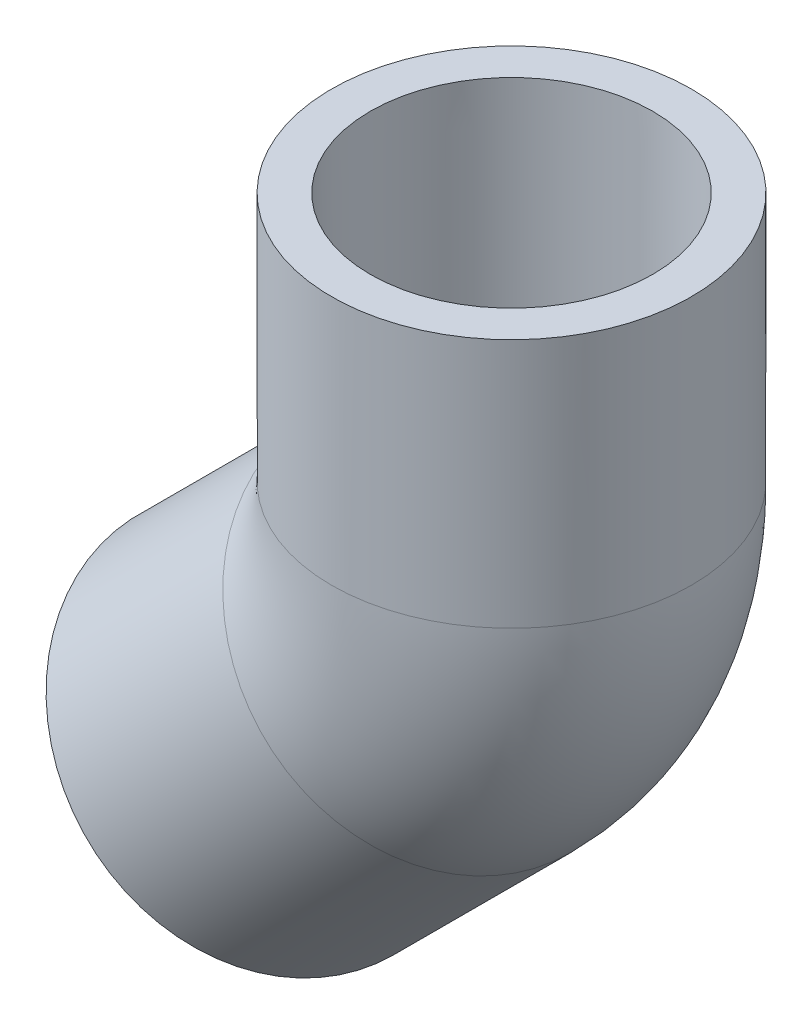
from build123d import *

# Parameters (mm, degrees)
SKETCH3_R   = 13.716
SKETCH3_R_2 = 7.8994


with BuildPart() as part:
    # Sketch1 → Revolve1 (revolve)
    with BuildSketch(Plane.XY):
        Polygon((-8.980256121, -28.377609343), (4.490128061, -14.907225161), (2.298945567, -12.716042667), (-11.063675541, -26.294189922), align=None)
    revolve(axis=Axis((-18.678932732, -18.678932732, 0), (0.7071067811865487, 0.7071067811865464, 0)))



with BuildPart() as body_2:
    # Sketch2 → Revolve2 (revolve)
    with BuildSketch(Plane.XY, mode=Mode.PRIVATE) as revolve2_sk:
        Polygon((10.7696, 26.416), (10.6172, 7.366), (13.716, 7.366), (13.716, 26.416), align=None)
    revolve(revolve2_sk.sketch.rotate(Axis((0, 0, 0), (0, 1, 0)), 90), axis=Axis((0, 0, 0), (0, 1, 0)))


with BuildPart() as part_1:
    add(part.part)

    add(body_2.part)  # Sweep1 merges body 2
    # Sweep1: sweep along a path in Sketch4
    with BuildLine(Plane.XY) as sweep1_path:
        ThreePointArc((-5.20854855, -5.20854855), (-1.353657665, 0.560703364), (0, 7.366))
    # Sketch3 → Sweep1 (sweep)
    with BuildSketch(Plane(origin=(-5.20854855, -5.20854855, 0), x_dir=(0, 0, -1), z_dir=(0.7071067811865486, 0.7071067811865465, 0))):
        Circle(SKETCH3_R)
        Circle(SKETCH3_R_2, mode=Mode.SUBTRACT)
    sweep(path=sweep1_path.line)


solid = part_1.part
